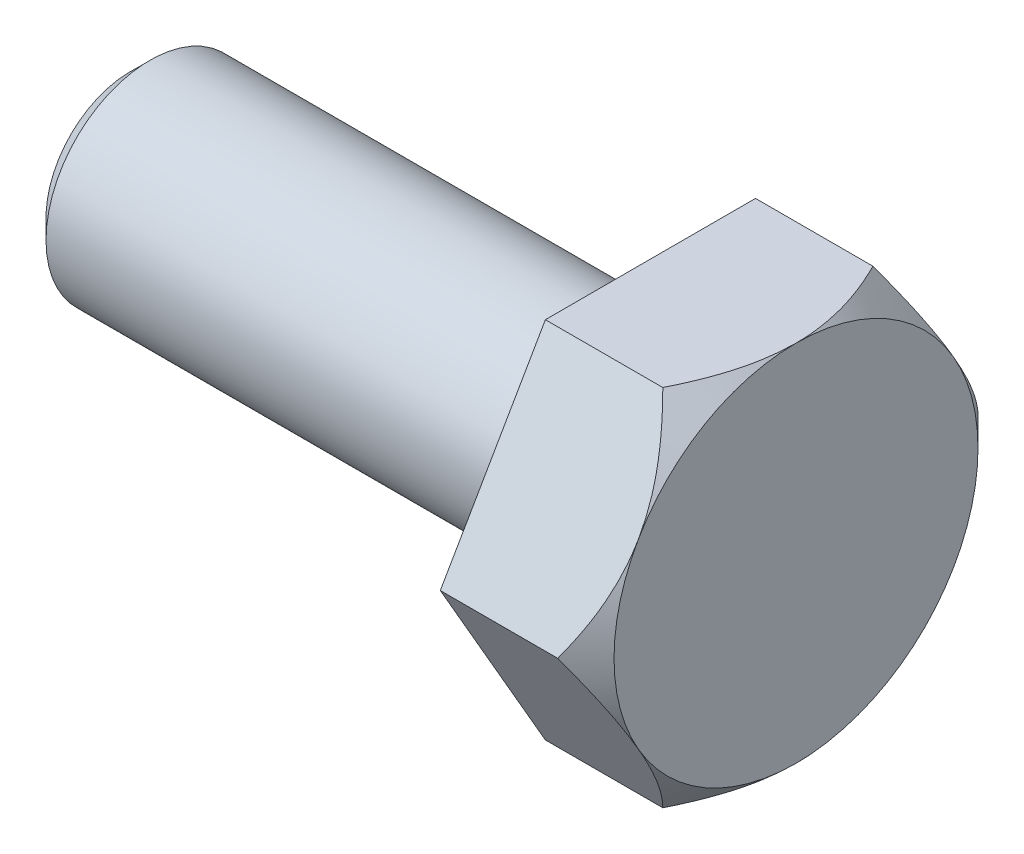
ISO-10303-21;
HEADER;
FILE_DESCRIPTION(('STEP AP214'),'2;1');
FILE_NAME('part.step','',(''),(''),'','','');
FILE_SCHEMA(('AUTOMOTIVE_DESIGN { 1 0 10303 214 1 1 1 1 }'));
ENDSEC;
DATA;
#1=APPLICATION_CONTEXT('core data for automotive mechanical design processes');
#2=APPLICATION_PROTOCOL_DEFINITION('international standard','automotive_design',2000,#1);
#3=PRODUCT_CONTEXT('',#1,'mechanical');
#4=PRODUCT('Part','Part','',(#3));
#5=PRODUCT_RELATED_PRODUCT_CATEGORY('part','',(#4));
#6=PRODUCT_DEFINITION_FORMATION('','',#4);
#7=PRODUCT_DEFINITION_CONTEXT('part definition',#1,'design');
#8=PRODUCT_DEFINITION('design','',#6,#7);
#9=PRODUCT_DEFINITION_SHAPE('','',#8);
#10=(LENGTH_UNIT() NAMED_UNIT(*) SI_UNIT(.MILLI.,.METRE.));
#11=(NAMED_UNIT(*) PLANE_ANGLE_UNIT() SI_UNIT($,.RADIAN.));
#12=(NAMED_UNIT(*) SI_UNIT($,.STERADIAN.) SOLID_ANGLE_UNIT());
#13=UNCERTAINTY_MEASURE_WITH_UNIT(LENGTH_MEASURE(1.E-05),#10,'distance_accuracy_value','');
#14=(GEOMETRIC_REPRESENTATION_CONTEXT(3) GLOBAL_UNCERTAINTY_ASSIGNED_CONTEXT((#13)) GLOBAL_UNIT_ASSIGNED_CONTEXT((#10,
#11,#12)) REPRESENTATION_CONTEXT('',''));
#15=CARTESIAN_POINT('',(0.,0.,0.));
#16=DIRECTION('',(0.,0.,1.));
#17=DIRECTION('',(1.,0.,0.));
#18=AXIS2_PLACEMENT_3D('',#15,#16,#17);
#19=CARTESIAN_POINT('',(-10.001,-3.49999999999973,-2.0207259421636));
#20=DIRECTION('',(0.,-0.5,-0.866025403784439));
#21=DIRECTION('',(0.,0.866025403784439,-0.5));
#22=AXIS2_PLACEMENT_3D('',#19,#20,#21);
#23=PLANE('',#22);
#24=DIRECTION('',(1.,0.,0.));
#25=VECTOR('',#24,1.);
#26=CARTESIAN_POINT('',(-10.001,2.22044604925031E-13,-4.04145188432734));
#27=LINE('',#26,#25);
#28=CARTESIAN_POINT('',(0.,2.22044604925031E-13,-4.04145188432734));
#29=VERTEX_POINT('',#28);
#30=CARTESIAN_POINT('',(2.25854811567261,2.22044604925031E-13,-4.04145188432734));
#31=VERTEX_POINT('',#30);
#32=EDGE_CURVE('E391',#29,#31,#27,.T.);
#33=ORIENTED_EDGE('',*,*,#32,.T.);
#34=CARTESIAN_POINT('',(2.25843264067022,0.000200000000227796,-4.04156735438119));
#35=CARTESIAN_POINT('',(2.32783218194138,-0.120108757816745,-3.97210706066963));
#36=CARTESIAN_POINT('',(2.39315563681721,-0.24242921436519,-3.90148531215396));
#37=CARTESIAN_POINT('',(2.51276106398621,-0.491853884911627,-3.75747991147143));
#38=CARTESIAN_POINT('',(2.56697649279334,-0.618981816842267,-3.68408256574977));
#39=CARTESIAN_POINT('',(2.65984844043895,-0.875329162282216,-3.53608035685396));
#40=CARTESIAN_POINT('',(2.69873837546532,-1.00448329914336,-3.46151318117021));
#41=CARTESIAN_POINT('',(2.75865621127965,-1.26563479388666,-3.31073729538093));
#42=CARTESIAN_POINT('',(2.77972883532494,-1.39762417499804,-3.23453319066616));
#43=CARTESIAN_POINT('',(2.79874200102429,-1.62510370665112,-3.10319782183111));
#44=CARTESIAN_POINT('',(2.80155641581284,-1.72030010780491,-3.04823615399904));
#45=CARTESIAN_POINT('',(2.79681342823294,-1.91053805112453,-2.93840222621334));
#46=CARTESIAN_POINT('',(2.78925238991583,-2.00557952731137,-2.88353000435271));
#47=CARTESIAN_POINT('',(2.76419021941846,-2.19476205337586,-2.7743054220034));
#48=CARTESIAN_POINT('',(2.74667796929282,-2.28890197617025,-2.71995371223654));
#49=CARTESIAN_POINT('',(2.70266921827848,-2.47556499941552,-2.61218376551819));
#50=CARTESIAN_POINT('',(2.67617340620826,-2.56808822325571,-2.55876545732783));
#51=CARTESIAN_POINT('',(2.62166014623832,-2.73234167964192,-2.46393368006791));
#52=CARTESIAN_POINT('',(2.59507581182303,-2.80443551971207,-2.42231028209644));
#53=CARTESIAN_POINT('',(2.53762274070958,-2.9473289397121,-2.33981072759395));
#54=CARTESIAN_POINT('',(2.5067538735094,-3.01812848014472,-2.29893459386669));
#55=CARTESIAN_POINT('',(2.44142377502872,-3.15821024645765,-2.21805834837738));
#56=CARTESIAN_POINT('',(2.4069738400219,-3.22749645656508,-2.17805593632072));
#57=CARTESIAN_POINT('',(2.33493401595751,-3.36478573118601,-2.09879193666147));
#58=CARTESIAN_POINT('',(2.29734605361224,-3.43278955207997,-2.05952991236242));
#59=CARTESIAN_POINT('',(2.25843264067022,-3.50019999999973,-2.02061047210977));
#60=B_SPLINE_CURVE_WITH_KNOTS('',3,(#34,#35,#36,#37,#38,#39,#40,#41,#42,#43,#44,#45,#46,#47,#48,
#49,#50,#51,#52,#53,#54,#55,#56,#57,#58,#59),.UNSPECIFIED.,.F.,.F.,(4,2,2,2,2,2,2,2,2,2,2,2,4),
(0.,0.466195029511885,0.935106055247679,1.3965703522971,1.85687285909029,2.18628459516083,
2.51581179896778,2.84570789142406,3.17557869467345,3.43762138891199,3.69967206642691,
3.96091985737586,4.22200840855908),.UNSPECIFIED.);
#61=CARTESIAN_POINT('',(2.8,-1.75000000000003,-3.03108891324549));
#62=VERTEX_POINT('',#61);
#63=EDGE_CURVE('E189',#31,#62,#60,.T.);
#64=ORIENTED_EDGE('',*,*,#63,.T.);
#65=CARTESIAN_POINT('',(2.25854811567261,-3.49999999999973,-2.0207259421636));
#66=VERTEX_POINT('',#65);
#67=EDGE_CURVE('E182',#62,#66,#60,.T.);
#68=ORIENTED_EDGE('',*,*,#67,.T.);
#69=DIRECTION('',(1.,0.,0.));
#70=VECTOR('',#69,1.);
#71=CARTESIAN_POINT('',(-10.001,-3.49999999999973,-2.0207259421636));
#72=LINE('',#71,#70);
#73=CARTESIAN_POINT('',(0.,-3.49999999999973,-2.0207259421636));
#74=VERTEX_POINT('',#73);
#75=EDGE_CURVE('E223',#74,#66,#72,.T.);
#76=ORIENTED_EDGE('',*,*,#75,.F.);
#77=DIRECTION('',(0.,-0.866025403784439,0.5));
#78=VECTOR('',#77,1.);
#79=CARTESIAN_POINT('',(0.,-3.49999999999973,-2.0207259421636));
#80=LINE('',#79,#78);
#81=EDGE_CURVE('E383',#29,#74,#80,.T.);
#82=ORIENTED_EDGE('',*,*,#81,.F.);
#83=EDGE_LOOP('',(#33,#64,#68,#76,#82));
#84=FACE_BOUND('',#83,.T.);
#85=ADVANCED_FACE('F37',(#84),#23,.T.);
#86=CARTESIAN_POINT('',(-10.001,-3.49999999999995,2.02072594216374));
#87=DIRECTION('',(0.,-1.,0.));
#88=DIRECTION('',(0.,0.,-1.));
#89=AXIS2_PLACEMENT_3D('',#86,#87,#88);
#90=PLANE('',#89);
#91=ORIENTED_EDGE('',*,*,#75,.T.);
#92=CARTESIAN_POINT('',(0.542158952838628,-3.49999999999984,-4.57195073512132));
#93=CARTESIAN_POINT('',(0.628870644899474,-3.49999999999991,-4.46272363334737));
#94=CARTESIAN_POINT('',(0.714904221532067,-3.49999999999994,-4.35295016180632));
#95=CARTESIAN_POINT('',(0.885294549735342,-3.49999999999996,-4.13207353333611));
#96=CARTESIAN_POINT('',(0.96965094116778,-3.49999999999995,-4.0209700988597));
#97=CARTESIAN_POINT('',(1.13696180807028,-3.49999999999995,-3.7963936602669));
#98=CARTESIAN_POINT('',(1.21990078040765,-3.49999999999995,-3.6829090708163));
#99=CARTESIAN_POINT('',(1.38323362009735,-3.49999999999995,-3.45412965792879));
#100=CARTESIAN_POINT('',(1.46362765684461,-3.49999999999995,-3.33883495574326));
#101=CARTESIAN_POINT('',(1.62722860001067,-3.49999999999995,-3.09730190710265));
#102=CARTESIAN_POINT('',(1.71018840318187,-3.49999999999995,-2.97089536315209));
#103=CARTESIAN_POINT('',(1.8714648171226,-3.49999999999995,-2.71510311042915));
#104=CARTESIAN_POINT('',(1.94978056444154,-3.49999999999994,-2.58571685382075));
#105=CARTESIAN_POINT('',(2.10014378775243,-3.49999999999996,-2.32384459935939));
#106=CARTESIAN_POINT('',(2.17220948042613,-3.49999999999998,-2.1913691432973));
#107=CARTESIAN_POINT('',(2.30845808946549,-3.49999999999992,-1.92245621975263));
#108=CARTESIAN_POINT('',(2.37264497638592,-3.49999999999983,-1.78602079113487));
#109=CARTESIAN_POINT('',(2.48319784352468,-3.49999999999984,-1.52641495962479));
#110=CARTESIAN_POINT('',(2.53079268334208,-3.49999999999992,-1.40377315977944));
#111=CARTESIAN_POINT('',(2.61617968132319,-3.49999999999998,-1.15505879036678));
#112=CARTESIAN_POINT('',(2.65397127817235,-3.49999999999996,-1.02898602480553));
#113=CARTESIAN_POINT('',(2.71692182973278,-3.49999999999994,-0.776559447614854));
#114=CARTESIAN_POINT('',(2.74233570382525,-3.49999999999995,-0.650270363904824));
#115=CARTESIAN_POINT('',(2.77994489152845,-3.49999999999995,-0.395727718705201));
#116=CARTESIAN_POINT('',(2.79214402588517,-3.49999999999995,-0.267474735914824));
#117=CARTESIAN_POINT('',(2.80203592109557,-3.49999999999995,-0.0181361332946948));
#118=CARTESIAN_POINT('',(2.80055710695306,-3.49999999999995,0.102916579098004));
#119=CARTESIAN_POINT('',(2.78517636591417,-3.49999999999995,0.344224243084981));
#120=CARTESIAN_POINT('',(2.77127348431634,-3.49999999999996,0.46447913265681));
#121=CARTESIAN_POINT('',(2.73164524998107,-3.49999999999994,0.70537911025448));
#122=CARTESIAN_POINT('',(2.70569635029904,-3.49999999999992,0.825986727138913));
#123=CARTESIAN_POINT('',(2.64352126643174,-3.49999999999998,1.06447490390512));
#124=CARTESIAN_POINT('',(2.60729510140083,-3.50000000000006,1.18235546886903));
#125=CARTESIAN_POINT('',(2.52609337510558,-3.50000000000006,1.41577619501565));
#126=CARTESIAN_POINT('',(2.4810691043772,-3.49999999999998,1.53129917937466));
#127=CARTESIAN_POINT('',(2.38403692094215,-3.49999999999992,1.75938233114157));
#128=CARTESIAN_POINT('',(2.33202689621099,-3.49999999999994,1.87194159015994));
#129=CARTESIAN_POINT('',(2.22224710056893,-3.49999999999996,2.09463212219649));
#130=CARTESIAN_POINT('',(2.16445974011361,-3.49999999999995,2.20475465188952));
#131=CARTESIAN_POINT('',(2.04439292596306,-3.49999999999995,2.42248573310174));
#132=CARTESIAN_POINT('',(1.98211413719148,-3.49999999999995,2.53009465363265));
#133=CARTESIAN_POINT('',(1.85709927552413,-3.49999999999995,2.73786505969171));
#134=CARTESIAN_POINT('',(1.79453749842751,-3.49999999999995,2.8381319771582));
#135=CARTESIAN_POINT('',(1.66672604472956,-3.49999999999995,3.03694283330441));
#136=CARTESIAN_POINT('',(1.60147617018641,-3.49999999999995,3.13548664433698));
#137=CARTESIAN_POINT('',(1.46928894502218,-3.49999999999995,3.33029387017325));
#138=CARTESIAN_POINT('',(1.40236902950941,-3.49999999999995,3.42656915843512));
#139=CARTESIAN_POINT('',(1.2667159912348,-3.49999999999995,3.61779542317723));
#140=CARTESIAN_POINT('',(1.19798337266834,-3.49999999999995,3.71274675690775));
#141=CARTESIAN_POINT('',(1.12850803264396,-3.49999999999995,3.80714186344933));
#142=B_SPLINE_CURVE_WITH_KNOTS('',3,(#92,#93,#94,#95,#96,#97,#98,#99,#100,#101,#102,#103,#104,
#105,#106,#107,#108,#109,#110,#111,#112,#113,#114,#115,#116,#117,#118,#119,#120,#121,#122,#123,
#124,#125,#126,#127,#128,#129,#130,#131,#132,#133,#134,#135,#136,#137,#138,#139,#140,#141),
.UNSPECIFIED.,.F.,.F.,(4,2,2,2,2,2,2,2,2,2,2,2,2,2,2,2,2,2,2,2,2,2,2,2,4),(0.,0.418390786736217,
0.836870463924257,1.25852686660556,1.68015514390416,2.13367094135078,2.58727079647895,
3.03950071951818,3.49150179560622,3.88583148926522,4.28018375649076,4.66602925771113,
5.05176317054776,5.41429508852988,5.77685486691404,6.14642978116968,6.51600400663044,
6.8876854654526,7.25947954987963,7.63244221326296,8.00534977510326,8.35985131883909,
8.71437901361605,9.06610179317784,9.41772775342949),.UNSPECIFIED.);
#143=CARTESIAN_POINT('',(2.8,-3.49999999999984,0.));
#144=VERTEX_POINT('',#143);
#145=EDGE_CURVE('E181',#66,#144,#142,.T.);
#146=ORIENTED_EDGE('',*,*,#145,.T.);
#147=CARTESIAN_POINT('',(2.25854811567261,-3.49999999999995,2.02072594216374));
#148=VERTEX_POINT('',#147);
#149=EDGE_CURVE('E176',#144,#148,#142,.T.);
#150=ORIENTED_EDGE('',*,*,#149,.T.);
#151=DIRECTION('',(1.,0.,0.));
#152=VECTOR('',#151,1.);
#153=CARTESIAN_POINT('',(-10.001,-3.49999999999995,2.02072594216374));
#154=LINE('',#153,#152);
#155=CARTESIAN_POINT('',(0.,-3.49999999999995,2.02072594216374));
#156=VERTEX_POINT('',#155);
#157=EDGE_CURVE('E379',#156,#148,#154,.T.);
#158=ORIENTED_EDGE('',*,*,#157,.F.);
#159=DIRECTION('',(0.,0.,1.));
#160=VECTOR('',#159,1.);
#161=CARTESIAN_POINT('',(0.,-3.49999999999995,2.02072594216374));
#162=LINE('',#161,#160);
#163=EDGE_CURVE('E376',#74,#156,#162,.T.);
#164=ORIENTED_EDGE('',*,*,#163,.F.);
#165=EDGE_LOOP('',(#91,#146,#150,#158,#164));
#166=FACE_BOUND('',#165,.T.);
#167=ADVANCED_FACE('F163',(#166),#90,.T.);
#168=CARTESIAN_POINT('',(-10.001,0.,4.04145188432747));
#169=DIRECTION('',(0.,-0.5,0.866025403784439));
#170=DIRECTION('',(0.,-0.866025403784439,-0.5));
#171=AXIS2_PLACEMENT_3D('',#168,#169,#170);
#172=PLANE('',#171);
#173=ORIENTED_EDGE('',*,*,#157,.T.);
#174=CARTESIAN_POINT('',(2.25843264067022,-3.50019999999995,2.02061047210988));
#175=CARTESIAN_POINT('',(2.32783218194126,-3.37989124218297,2.09007076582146));
#176=CARTESIAN_POINT('',(2.39315563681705,-3.25757078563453,2.16069251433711));
#177=CARTESIAN_POINT('',(2.51276106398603,-3.00814611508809,2.30469791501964));
#178=CARTESIAN_POINT('',(2.56697649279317,-2.88101818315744,2.37809526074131));
#179=CARTESIAN_POINT('',(2.65984844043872,-2.62467083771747,2.52609746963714));
#180=CARTESIAN_POINT('',(2.69873837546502,-2.49551670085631,2.6006646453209));
#181=CARTESIAN_POINT('',(2.75865621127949,-2.23436520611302,2.75144053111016));
#182=CARTESIAN_POINT('',(2.779728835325,-2.10237582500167,2.82764463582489));
#183=CARTESIAN_POINT('',(2.79874200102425,-1.87489629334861,2.95898000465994));
#184=CARTESIAN_POINT('',(2.8015564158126,-1.77969989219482,3.01394167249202));
#185=CARTESIAN_POINT('',(2.79681342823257,-1.58946194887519,3.12377560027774));
#186=CARTESIAN_POINT('',(2.78925238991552,-1.49442047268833,3.17864782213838));
#187=CARTESIAN_POINT('',(2.76419021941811,-1.30523794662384,3.28787240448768));
#188=CARTESIAN_POINT('',(2.74667796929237,-1.21109802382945,3.34222411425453));
#189=CARTESIAN_POINT('',(2.70266921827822,-1.02443500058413,3.44999406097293));
#190=CARTESIAN_POINT('',(2.6761734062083,-0.931911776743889,3.50341236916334));
#191=CARTESIAN_POINT('',(2.62166014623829,-0.767658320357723,3.59824414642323));
#192=CARTESIAN_POINT('',(2.59507581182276,-0.695564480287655,3.63986754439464));
#193=CARTESIAN_POINT('',(2.53762274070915,-0.552671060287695,3.72236709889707));
#194=CARTESIAN_POINT('',(2.50675387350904,-0.481871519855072,3.76324323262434));
#195=CARTESIAN_POINT('',(2.4414237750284,-0.341789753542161,3.84411947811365));
#196=CARTESIAN_POINT('',(2.40697384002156,-0.272503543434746,3.8841218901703));
#197=CARTESIAN_POINT('',(2.33493401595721,-0.135214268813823,3.96338588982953));
#198=CARTESIAN_POINT('',(2.29734605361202,-0.0672104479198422,4.00264791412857));
#199=CARTESIAN_POINT('',(2.25843264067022,0.000200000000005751,4.04156735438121));
#200=B_SPLINE_CURVE_WITH_KNOTS('',3,(#174,#175,#176,#177,#178,#179,#180,#181,#182,#183,#184,
#185,#186,#187,#188,#189,#190,#191,#192,#193,#194,#195,#196,#197,#198,#199),.UNSPECIFIED.,.F.,
.F.,(4,2,2,2,2,2,2,2,2,2,2,2,4),(0.,0.466195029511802,0.935106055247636,1.39657035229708,
1.85687285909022,2.18628459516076,2.51581179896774,2.84570789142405,3.17557869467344,
3.43762138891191,3.69967206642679,3.96091985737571,4.22200840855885),.UNSPECIFIED.);
#201=CARTESIAN_POINT('',(2.8,-1.74999999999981,3.03108891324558));
#202=VERTEX_POINT('',#201);
#203=EDGE_CURVE('E139',#148,#202,#200,.T.);
#204=ORIENTED_EDGE('',*,*,#203,.T.);
#205=CARTESIAN_POINT('',(2.25854811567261,0.,4.04145188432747));
#206=VERTEX_POINT('',#205);
#207=EDGE_CURVE('E126',#202,#206,#200,.T.);
#208=ORIENTED_EDGE('',*,*,#207,.T.);
#209=DIRECTION('',(1.,0.,0.));
#210=VECTOR('',#209,1.);
#211=CARTESIAN_POINT('',(-10.001,0.,4.04145188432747));
#212=LINE('',#211,#210);
#213=CARTESIAN_POINT('',(0.,0.,4.04145188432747));
#214=VERTEX_POINT('',#213);
#215=EDGE_CURVE('E138',#214,#206,#212,.T.);
#216=ORIENTED_EDGE('',*,*,#215,.F.);
#217=DIRECTION('',(0.,0.866025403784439,0.5));
#218=VECTOR('',#217,1.);
#219=CARTESIAN_POINT('',(0.,0.,4.04145188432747));
#220=LINE('',#219,#218);
#221=EDGE_CURVE('E394',#156,#214,#220,.T.);
#222=ORIENTED_EDGE('',*,*,#221,.F.);
#223=EDGE_LOOP('',(#173,#204,#208,#216,#222));
#224=FACE_BOUND('',#223,.T.);
#225=ADVANCED_FACE('F288',(#224),#172,.T.);
#226=CARTESIAN_POINT('',(-10.001,3.49999999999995,2.02072594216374));
#227=DIRECTION('',(0.,0.5,0.866025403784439));
#228=DIRECTION('',(0.,-0.866025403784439,0.5));
#229=AXIS2_PLACEMENT_3D('',#226,#227,#228);
#230=PLANE('',#229);
#231=ORIENTED_EDGE('',*,*,#215,.T.);
#232=CARTESIAN_POINT('',(2.25843264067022,-0.000200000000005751,4.04156735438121));
#233=CARTESIAN_POINT('',(2.32783218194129,0.120108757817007,3.9721070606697));
#234=CARTESIAN_POINT('',(2.39315563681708,0.242429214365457,3.90148531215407));
#235=CARTESIAN_POINT('',(2.51276106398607,0.491853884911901,3.75747991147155));
#236=CARTESIAN_POINT('',(2.56697649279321,0.618981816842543,3.68408256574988));
#237=CARTESIAN_POINT('',(2.65984844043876,0.875329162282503,3.53608035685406));
#238=CARTESIAN_POINT('',(2.69873837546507,1.00448329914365,3.4615131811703));
#239=CARTESIAN_POINT('',(2.75865621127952,1.26563479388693,3.31073729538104));
#240=CARTESIAN_POINT('',(2.77972883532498,1.39762417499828,3.23453319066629));
#241=CARTESIAN_POINT('',(2.79874200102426,1.62510370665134,3.10319782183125));
#242=CARTESIAN_POINT('',(2.80155641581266,1.72030010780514,3.04823615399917));
#243=CARTESIAN_POINT('',(2.79681342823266,1.91053805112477,2.93840222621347));
#244=CARTESIAN_POINT('',(2.78925238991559,2.00557952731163,2.88353000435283));
#245=CARTESIAN_POINT('',(2.7641902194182,2.19476205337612,2.77430542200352));
#246=CARTESIAN_POINT('',(2.74667796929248,2.28890197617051,2.71995371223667));
#247=CARTESIAN_POINT('',(2.70266921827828,2.47556499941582,2.61218376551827));
#248=CARTESIAN_POINT('',(2.67617340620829,2.56808822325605,2.55876545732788));
#249=CARTESIAN_POINT('',(2.6216601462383,2.73234167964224,2.46393368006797));
#250=CARTESIAN_POINT('',(2.59507581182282,2.80443551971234,2.42231028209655));
#251=CARTESIAN_POINT('',(2.53762274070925,2.94732893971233,2.33981072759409));
#252=CARTESIAN_POINT('',(2.50675387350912,3.01812848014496,2.29893459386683));
#253=CARTESIAN_POINT('',(2.44142377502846,3.15821024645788,2.21805834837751));
#254=CARTESIAN_POINT('',(2.40697384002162,3.22749645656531,2.17805593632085));
#255=CARTESIAN_POINT('',(2.33493401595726,3.36478573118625,2.09879193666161));
#256=CARTESIAN_POINT('',(2.29734605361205,3.43278955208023,2.05952991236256));
#257=CARTESIAN_POINT('',(2.25843264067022,3.50020000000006,2.02061047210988));
#258=B_SPLINE_CURVE_WITH_KNOTS('',3,(#232,#233,#234,#235,#236,#237,#238,#239,#240,#241,#242,
#243,#244,#245,#246,#247,#248,#249,#250,#251,#252,#253,#254,#255,#256,#257),.UNSPECIFIED.,.F.,
.F.,(4,2,2,2,2,2,2,2,2,2,2,2,4),(0.,0.466195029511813,0.93510605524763,1.39657035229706,
1.85687285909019,2.18628459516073,2.51581179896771,2.84570789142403,3.17557869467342,
3.43762138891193,3.69967206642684,3.9609198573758,4.22200840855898),.UNSPECIFIED.);
#259=CARTESIAN_POINT('',(2.8,1.75000000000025,3.03108891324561));
#260=VERTEX_POINT('',#259);
#261=EDGE_CURVE('E119',#206,#260,#258,.T.);
#262=ORIENTED_EDGE('',*,*,#261,.T.);
#263=CARTESIAN_POINT('',(2.25854811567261,3.49999999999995,2.02072594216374));
#264=VERTEX_POINT('',#263);
#265=EDGE_CURVE('E108',#260,#264,#258,.T.);
#266=ORIENTED_EDGE('',*,*,#265,.T.);
#267=DIRECTION('',(1.,0.,0.));
#268=VECTOR('',#267,1.);
#269=CARTESIAN_POINT('',(-10.001,3.49999999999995,2.02072594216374));
#270=LINE('',#269,#268);
#271=CARTESIAN_POINT('',(0.,3.49999999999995,2.02072594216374));
#272=VERTEX_POINT('',#271);
#273=EDGE_CURVE('E387',#272,#264,#270,.T.);
#274=ORIENTED_EDGE('',*,*,#273,.F.);
#275=DIRECTION('',(0.,0.866025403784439,-0.5));
#276=VECTOR('',#275,1.);
#277=CARTESIAN_POINT('',(0.,3.49999999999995,2.02072594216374));
#278=LINE('',#277,#276);
#279=EDGE_CURVE('E396',#214,#272,#278,.T.);
#280=ORIENTED_EDGE('',*,*,#279,.F.);
#281=EDGE_LOOP('',(#231,#262,#266,#274,#280));
#282=FACE_BOUND('',#281,.T.);
#283=ADVANCED_FACE('F136',(#282),#230,.T.);
#284=CARTESIAN_POINT('',(-10.001,3.50000000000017,-2.02072594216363));
#285=DIRECTION('',(0.,1.,0.));
#286=DIRECTION('',(0.,0.,1.));
#287=AXIS2_PLACEMENT_3D('',#284,#285,#286);
#288=PLANE('',#287);
#289=ORIENTED_EDGE('',*,*,#273,.T.);
#290=CARTESIAN_POINT('',(0.542158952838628,3.50000000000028,-4.57195073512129));
#291=CARTESIAN_POINT('',(0.628870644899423,3.50000000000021,-4.46272363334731));
#292=CARTESIAN_POINT('',(0.714904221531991,3.50000000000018,-4.35295016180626));
#293=CARTESIAN_POINT('',(0.88529454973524,3.50000000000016,-4.13207353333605));
#294=CARTESIAN_POINT('',(0.969650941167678,3.50000000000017,-4.02097009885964));
#295=CARTESIAN_POINT('',(1.13696180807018,3.50000000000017,-3.79639366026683));
#296=CARTESIAN_POINT('',(1.21990078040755,3.50000000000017,-3.68290907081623));
#297=CARTESIAN_POINT('',(1.38323362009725,3.50000000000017,-3.45412965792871));
#298=CARTESIAN_POINT('',(1.46362765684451,3.50000000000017,-3.33883495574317));
#299=CARTESIAN_POINT('',(1.62722860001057,3.50000000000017,-3.09730190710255));
#300=CARTESIAN_POINT('',(1.71018840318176,3.50000000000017,-2.97089536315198));
#301=CARTESIAN_POINT('',(1.8714648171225,3.50000000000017,-2.71510311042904));
#302=CARTESIAN_POINT('',(1.94978056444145,3.50000000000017,-2.58571685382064));
#303=CARTESIAN_POINT('',(2.1001437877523,3.50000000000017,-2.32384459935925));
#304=CARTESIAN_POINT('',(2.17220948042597,3.50000000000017,-2.19136914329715));
#305=CARTESIAN_POINT('',(2.3084580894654,3.50000000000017,-1.92245621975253));
#306=CARTESIAN_POINT('',(2.37264497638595,3.50000000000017,-1.78602079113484));
#307=CARTESIAN_POINT('',(2.48319784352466,3.50000000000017,-1.52641495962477));
#308=CARTESIAN_POINT('',(2.53079268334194,3.50000000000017,-1.40377315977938));
#309=CARTESIAN_POINT('',(2.61617968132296,3.50000000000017,-1.15505879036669));
#310=CARTESIAN_POINT('',(2.65397127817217,3.50000000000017,-1.02898602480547));
#311=CARTESIAN_POINT('',(2.71692182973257,3.50000000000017,-0.776559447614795));
#312=CARTESIAN_POINT('',(2.74233570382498,3.50000000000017,-0.65027036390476));
#313=CARTESIAN_POINT('',(2.77994489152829,3.50000000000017,-0.395727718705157));
#314=CARTESIAN_POINT('',(2.79214402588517,3.50000000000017,-0.267474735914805));
#315=CARTESIAN_POINT('',(2.80203592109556,3.50000000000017,-0.0181361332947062));
#316=CARTESIAN_POINT('',(2.80055710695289,3.50000000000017,0.102916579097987));
#317=CARTESIAN_POINT('',(2.7851763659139,3.50000000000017,0.344224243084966));
#318=CARTESIAN_POINT('',(2.77127348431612,3.50000000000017,0.464479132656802));
#319=CARTESIAN_POINT('',(2.73164524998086,3.50000000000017,0.705379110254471));
#320=CARTESIAN_POINT('',(2.70569635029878,3.50000000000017,0.825986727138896));
#321=CARTESIAN_POINT('',(2.64352126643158,3.50000000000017,1.06447490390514));
#322=CARTESIAN_POINT('',(2.60729510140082,3.50000000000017,1.18235546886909));
#323=CARTESIAN_POINT('',(2.52609337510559,3.50000000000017,1.41577619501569));
#324=CARTESIAN_POINT('',(2.48106910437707,3.50000000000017,1.53129917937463));
#325=CARTESIAN_POINT('',(2.38403692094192,3.50000000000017,1.75938233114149));
#326=CARTESIAN_POINT('',(2.33202689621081,3.50000000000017,1.87194159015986));
#327=CARTESIAN_POINT('',(2.22224710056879,3.50000000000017,2.09463212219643));
#328=CARTESIAN_POINT('',(2.16445974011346,3.50000000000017,2.20475465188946));
#329=CARTESIAN_POINT('',(2.04439292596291,3.50000000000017,2.42248573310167));
#330=CARTESIAN_POINT('',(1.98211413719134,3.50000000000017,2.5300946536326));
#331=CARTESIAN_POINT('',(1.85709927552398,3.50000000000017,2.73786505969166));
#332=CARTESIAN_POINT('',(1.79453749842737,3.50000000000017,2.83813197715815));
#333=CARTESIAN_POINT('',(1.66672604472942,3.50000000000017,3.03694283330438));
#334=CARTESIAN_POINT('',(1.60147617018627,3.50000000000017,3.13548664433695));
#335=CARTESIAN_POINT('',(1.46928894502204,3.50000000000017,3.33029387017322));
#336=CARTESIAN_POINT('',(1.40236902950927,3.50000000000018,3.42656915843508));
#337=CARTESIAN_POINT('',(1.26671599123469,3.50000000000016,3.61779542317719));
#338=CARTESIAN_POINT('',(1.19798337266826,3.50000000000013,3.71274675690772));
#339=CARTESIAN_POINT('',(1.12850803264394,3.50000000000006,3.80714186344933));
#340=B_SPLINE_CURVE_WITH_KNOTS('',3,(#290,#291,#292,#293,#294,#295,#296,#297,#298,#299,#300,
#301,#302,#303,#304,#305,#306,#307,#308,#309,#310,#311,#312,#313,#314,#315,#316,#317,#318,#319,
#320,#321,#322,#323,#324,#325,#326,#327,#328,#329,#330,#331,#332,#333,#334,#335,#336,#337,#338,
#339),.UNSPECIFIED.,.F.,.F.,(4,2,2,2,2,2,2,2,2,2,2,2,2,2,2,2,2,2,2,2,2,2,2,2,4),(0.,
0.418390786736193,0.836870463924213,1.25852686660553,1.68015514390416,2.13367094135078,
2.58727079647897,3.03950071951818,3.49150179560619,3.88583148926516,4.28018375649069,
4.66602925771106,5.05176317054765,5.41429508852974,5.77685486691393,6.14642978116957,
6.51600400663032,6.88768546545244,7.25947954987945,7.63244221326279,8.00534977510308,
8.35985131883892,8.7143790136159,9.06610179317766,9.41772775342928),.UNSPECIFIED.);
#341=CARTESIAN_POINT('',(2.8,3.50000000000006,0.));
#342=VERTEX_POINT('',#341);
#343=EDGE_CURVE('E114',#264,#342,#340,.F.);
#344=ORIENTED_EDGE('',*,*,#343,.T.);
#345=CARTESIAN_POINT('',(2.25854811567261,3.50000000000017,-2.02072594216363));
#346=VERTEX_POINT('',#345);
#347=EDGE_CURVE('E53',#342,#346,#340,.F.);
#348=ORIENTED_EDGE('',*,*,#347,.T.);
#349=DIRECTION('',(1.,0.,0.));
#350=VECTOR('',#349,1.);
#351=CARTESIAN_POINT('',(-10.001,3.50000000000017,-2.02072594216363));
#352=LINE('',#351,#350);
#353=CARTESIAN_POINT('',(0.,3.50000000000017,-2.02072594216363));
#354=VERTEX_POINT('',#353);
#355=EDGE_CURVE('E389',#354,#346,#352,.T.);
#356=ORIENTED_EDGE('',*,*,#355,.F.);
#357=DIRECTION('',(0.,0.,-1.));
#358=VECTOR('',#357,1.);
#359=CARTESIAN_POINT('',(0.,3.50000000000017,-2.02072594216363));
#360=LINE('',#359,#358);
#361=EDGE_CURVE('E190',#272,#354,#360,.T.);
#362=ORIENTED_EDGE('',*,*,#361,.F.);
#363=EDGE_LOOP('',(#289,#344,#348,#356,#362));
#364=FACE_BOUND('',#363,.T.);
#365=ADVANCED_FACE('F268',(#364),#288,.T.);
#366=CARTESIAN_POINT('',(-10.001,2.22044604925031E-13,-4.04145188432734));
#367=DIRECTION('',(0.,0.5,-0.866025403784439));
#368=DIRECTION('',(0.,0.866025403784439,0.5));
#369=AXIS2_PLACEMENT_3D('',#366,#367,#368);
#370=PLANE('',#369);
#371=ORIENTED_EDGE('',*,*,#355,.T.);
#372=CARTESIAN_POINT('',(2.25843264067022,3.50020000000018,-2.02061047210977));
#373=CARTESIAN_POINT('',(2.32783218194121,3.37989124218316,-2.09007076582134));
#374=CARTESIAN_POINT('',(2.39315563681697,3.2575707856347,-2.160692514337));
#375=CARTESIAN_POINT('',(2.51276106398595,3.00814611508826,-2.30469791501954));
#376=CARTESIAN_POINT('',(2.56697649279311,2.88101818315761,-2.37809526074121));
#377=CARTESIAN_POINT('',(2.65984844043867,2.62467083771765,-2.52609746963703));
#378=CARTESIAN_POINT('',(2.69873837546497,2.4955167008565,-2.60066464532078));
#379=CARTESIAN_POINT('',(2.75865621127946,2.23436520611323,-2.75144053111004));
#380=CARTESIAN_POINT('',(2.77972883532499,2.10237582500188,-2.82764463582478));
#381=CARTESIAN_POINT('',(2.79874200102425,1.87489629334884,-2.95898000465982));
#382=CARTESIAN_POINT('',(2.80155641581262,1.77969989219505,-3.01394167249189));
#383=CARTESIAN_POINT('',(2.79681342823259,1.58946194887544,-3.12377560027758));
#384=CARTESIAN_POINT('',(2.78925238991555,1.49442047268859,-3.17864782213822));
#385=CARTESIAN_POINT('',(2.76419021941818,1.30523794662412,-3.28787240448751));
#386=CARTESIAN_POINT('',(2.74667796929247,1.21109802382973,-3.34222411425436));
#387=CARTESIAN_POINT('',(2.70266921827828,1.02443500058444,-3.44999406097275));
#388=CARTESIAN_POINT('',(2.67617340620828,0.931911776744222,-3.50341236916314));
#389=CARTESIAN_POINT('',(2.6216601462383,0.767658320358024,-3.59824414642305));
#390=CARTESIAN_POINT('',(2.59507581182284,0.695564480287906,-3.63986754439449));
#391=CARTESIAN_POINT('',(2.53762274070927,0.552671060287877,-3.72236709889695));
#392=CARTESIAN_POINT('',(2.50675387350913,0.481871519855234,-3.76324323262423));
#393=CARTESIAN_POINT('',(2.44142377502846,0.34178975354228,-3.84411947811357));
#394=CARTESIAN_POINT('',(2.40697384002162,0.272503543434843,-3.88412189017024));
#395=CARTESIAN_POINT('',(2.33493401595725,0.135214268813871,-3.96338588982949));
#396=CARTESIAN_POINT('',(2.29734605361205,0.0672104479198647,-4.00264791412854));
#397=CARTESIAN_POINT('',(2.25843264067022,-0.000200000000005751,-4.04156735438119));
#398=B_SPLINE_CURVE_WITH_KNOTS('',3,(#372,#373,#374,#375,#376,#377,#378,#379,#380,#381,#382,
#383,#384,#385,#386,#387,#388,#389,#390,#391,#392,#393,#394,#395,#396,#397),.UNSPECIFIED.,.F.,
.F.,(4,2,2,2,2,2,2,2,2,2,2,2,4),(0.,0.466195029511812,0.935106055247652,1.39657035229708,
1.8568728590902,2.18628459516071,2.51581179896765,2.84570789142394,3.1755786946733,
3.43762138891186,3.69967206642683,3.96091985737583,4.22200840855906),.UNSPECIFIED.);
#399=CARTESIAN_POINT('',(2.8,1.75000000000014,-3.03108891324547));
#400=VERTEX_POINT('',#399);
#401=EDGE_CURVE('E401',#346,#400,#398,.T.);
#402=ORIENTED_EDGE('',*,*,#401,.T.);
#403=EDGE_CURVE('E60',#400,#31,#398,.T.);
#404=ORIENTED_EDGE('',*,*,#403,.T.);
#405=ORIENTED_EDGE('',*,*,#32,.F.);
#406=DIRECTION('',(0.,-0.866025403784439,-0.5));
#407=VECTOR('',#406,1.);
#408=CARTESIAN_POINT('',(0.,2.22044604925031E-13,-4.04145188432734));
#409=LINE('',#408,#407);
#410=EDGE_CURVE('E219',#354,#29,#409,.T.);
#411=ORIENTED_EDGE('',*,*,#410,.F.);
#412=EDGE_LOOP('',(#371,#402,#404,#405,#411));
#413=FACE_BOUND('',#412,.T.);
#414=ADVANCED_FACE('F196',(#413),#370,.T.);
#415=CARTESIAN_POINT('',(0.,-2.,1.11022302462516E-13));
#416=DIRECTION('',(1.,0.,0.));
#417=DIRECTION('',(0.,0.,-1.));
#418=AXIS2_PLACEMENT_3D('',#415,#416,#417);
#419=PLANE('',#418);
#420=CARTESIAN_POINT('',(0.,0.,0.));
#421=DIRECTION('',(1.,0.,0.));
#422=DIRECTION('',(0.,0.,-1.));
#423=AXIS2_PLACEMENT_3D('',#420,#421,#422);
#424=CIRCLE('',#423,2.);
#425=CARTESIAN_POINT('',(0.,0.,-2.));
#426=VERTEX_POINT('',#425);
#427=EDGE_CURVE('E218',#426,#426,#424,.T.);
#428=ORIENTED_EDGE('',*,*,#427,.T.);
#429=EDGE_LOOP('',(#428));
#430=FACE_BOUND('',#429,.T.);
#431=ORIENTED_EDGE('',*,*,#81,.T.);
#432=ORIENTED_EDGE('',*,*,#163,.T.);
#433=ORIENTED_EDGE('',*,*,#221,.T.);
#434=ORIENTED_EDGE('',*,*,#279,.T.);
#435=ORIENTED_EDGE('',*,*,#361,.T.);
#436=ORIENTED_EDGE('',*,*,#410,.T.);
#437=EDGE_LOOP('',(#431,#432,#433,#434,#435,#436));
#438=FACE_BOUND('',#437,.T.);
#439=ADVANCED_FACE('F205',(#430,#438),#419,.F.);
#440=CARTESIAN_POINT('',(12.4996303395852,0.,0.));
#441=DIRECTION('',(1.,0.,0.));
#442=DIRECTION('',(0.,0.,-1.));
#443=AXIS2_PLACEMENT_3D('',#440,#441,#442);
#444=CYLINDRICAL_SURFACE('',#443,2.);
#445=CARTESIAN_POINT('',(-9.62499999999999,0.,0.));
#446=DIRECTION('',(1.,0.,0.));
#447=DIRECTION('',(0.,0.,-1.));
#448=AXIS2_PLACEMENT_3D('',#445,#446,#447);
#449=CIRCLE('',#448,2.);
#450=CARTESIAN_POINT('',(-9.62499999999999,0.,-2.));
#451=VERTEX_POINT('',#450);
#452=EDGE_CURVE('E215',#451,#451,#449,.T.);
#453=ORIENTED_EDGE('',*,*,#452,.T.);
#454=EDGE_LOOP('',(#453));
#455=FACE_BOUND('',#454,.T.);
#456=ORIENTED_EDGE('',*,*,#427,.F.);
#457=EDGE_LOOP('',(#456));
#458=FACE_BOUND('',#457,.T.);
#459=ADVANCED_FACE('F201',(#455,#458),#444,.T.);
#460=CARTESIAN_POINT('',(-10.,-2.,1.11022302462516E-13));
#461=DIRECTION('',(1.,0.,0.));
#462=DIRECTION('',(0.,0.,-1.));
#463=AXIS2_PLACEMENT_3D('',#460,#461,#462);
#464=PLANE('',#463);
#465=CARTESIAN_POINT('',(-10.,0.,0.));
#466=DIRECTION('',(1.,0.,0.));
#467=DIRECTION('',(0.,0.,-1.));
#468=AXIS2_PLACEMENT_3D('',#465,#466,#467);
#469=CIRCLE('',#468,1.625);
#470=CARTESIAN_POINT('',(-10.,0.,-1.625));
#471=VERTEX_POINT('',#470);
#472=EDGE_CURVE('E131',#471,#471,#469,.F.);
#473=ORIENTED_EDGE('',*,*,#472,.T.);
#474=EDGE_LOOP('',(#473));
#475=FACE_BOUND('',#474,.T.);
#476=ADVANCED_FACE('F198',(#475),#464,.F.);
#477=CARTESIAN_POINT('',(-9.62499999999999,0.,0.));
#478=DIRECTION('',(1.,0.,0.));
#479=DIRECTION('',(0.,0.,-1.));
#480=AXIS2_PLACEMENT_3D('',#477,#478,#479);
#481=CONICAL_SURFACE('',#480,2.,0.785398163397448);
#482=ORIENTED_EDGE('',*,*,#472,.F.);
#483=EDGE_LOOP('',(#482));
#484=FACE_BOUND('',#483,.T.);
#485=ORIENTED_EDGE('',*,*,#452,.F.);
#486=EDGE_LOOP('',(#485));
#487=FACE_BOUND('',#486,.T.);
#488=ADVANCED_FACE('F39',(#484,#487),#481,.T.);
#489=CARTESIAN_POINT('',(2.8,0.,0.));
#490=DIRECTION('',(-1.,0.,0.));
#491=DIRECTION('',(0.,0.,-1.));
#492=AXIS2_PLACEMENT_3D('',#489,#490,#491);
#493=CONICAL_SURFACE('',#492,3.5,0.78539816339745);
#494=CARTESIAN_POINT('',(2.8,0.,0.));
#495=DIRECTION('',(-1.,0.,0.));
#496=DIRECTION('',(0.,0.,1.));
#497=AXIS2_PLACEMENT_3D('',#494,#495,#496);
#498=CIRCLE('',#497,3.5);
#499=EDGE_CURVE('E41',#202,#260,#498,.T.);
#500=ORIENTED_EDGE('',*,*,#499,.T.);
#501=ORIENTED_EDGE('',*,*,#261,.F.);
#502=ORIENTED_EDGE('',*,*,#207,.F.);
#503=EDGE_LOOP('',(#500,#501,#502));
#504=FACE_BOUND('',#503,.T.);
#505=ADVANCED_FACE('F124',(#504),#493,.T.);
#506=EDGE_CURVE('E130',#144,#202,#498,.T.);
#507=ORIENTED_EDGE('',*,*,#506,.T.);
#508=ORIENTED_EDGE('',*,*,#203,.F.);
#509=ORIENTED_EDGE('',*,*,#149,.F.);
#510=EDGE_LOOP('',(#507,#508,#509));
#511=FACE_BOUND('',#510,.T.);
#512=ADVANCED_FACE('F234',(#511),#493,.T.);
#513=EDGE_CURVE('E368',#62,#144,#498,.T.);
#514=ORIENTED_EDGE('',*,*,#513,.T.);
#515=ORIENTED_EDGE('',*,*,#145,.F.);
#516=ORIENTED_EDGE('',*,*,#67,.F.);
#517=EDGE_LOOP('',(#514,#515,#516));
#518=FACE_BOUND('',#517,.T.);
#519=ADVANCED_FACE('F238',(#518),#493,.T.);
#520=ORIENTED_EDGE('',*,*,#403,.F.);
#521=EDGE_CURVE('E46',#400,#62,#498,.T.);
#522=ORIENTED_EDGE('',*,*,#521,.T.);
#523=ORIENTED_EDGE('',*,*,#63,.F.);
#524=EDGE_LOOP('',(#520,#522,#523));
#525=FACE_BOUND('',#524,.T.);
#526=ADVANCED_FACE('F162',(#525),#493,.T.);
#527=CARTESIAN_POINT('',(2.8,0.,0.));
#528=DIRECTION('',(1.,0.,0.));
#529=DIRECTION('',(0.,0.,-1.));
#530=AXIS2_PLACEMENT_3D('',#527,#528,#529);
#531=CIRCLE('',#530,3.5);
#532=EDGE_CURVE('E134',#400,#342,#531,.T.);
#533=ORIENTED_EDGE('',*,*,#532,.F.);
#534=ORIENTED_EDGE('',*,*,#401,.F.);
#535=ORIENTED_EDGE('',*,*,#347,.F.);
#536=EDGE_LOOP('',(#533,#534,#535));
#537=FACE_BOUND('',#536,.T.);
#538=ADVANCED_FACE('F158',(#537),#493,.T.);
#539=EDGE_CURVE('E12',#260,#342,#498,.T.);
#540=ORIENTED_EDGE('',*,*,#539,.T.);
#541=ORIENTED_EDGE('',*,*,#343,.F.);
#542=ORIENTED_EDGE('',*,*,#265,.F.);
#543=EDGE_LOOP('',(#540,#541,#542));
#544=FACE_BOUND('',#543,.T.);
#545=ADVANCED_FACE('F110',(#544),#493,.T.);
#546=CARTESIAN_POINT('',(2.8,-5.24999999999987,0.));
#547=DIRECTION('',(-1.,0.,0.));
#548=DIRECTION('',(0.,0.,1.));
#549=AXIS2_PLACEMENT_3D('',#546,#547,#548);
#550=PLANE('',#549);
#551=ORIENTED_EDGE('',*,*,#539,.F.);
#552=ORIENTED_EDGE('',*,*,#499,.F.);
#553=ORIENTED_EDGE('',*,*,#506,.F.);
#554=ORIENTED_EDGE('',*,*,#513,.F.);
#555=ORIENTED_EDGE('',*,*,#521,.F.);
#556=ORIENTED_EDGE('',*,*,#532,.T.);
#557=EDGE_LOOP('',(#551,#552,#553,#554,#555,#556));
#558=FACE_BOUND('',#557,.T.);
#559=ADVANCED_FACE('F132',(#558),#550,.F.);
#560=CLOSED_SHELL('',(#85,#167,#225,#283,#365,#414,#439,#459,#476,#488,#505,#512,#519,#526,#538,
#545,#559));
#561=MANIFOLD_SOLID_BREP('B2',#560);
#562=ADVANCED_BREP_SHAPE_REPRESENTATION('',(#18,#561),#14);
#563=SHAPE_DEFINITION_REPRESENTATION(#9,#562);
ENDSEC;
END-ISO-10303-21;
